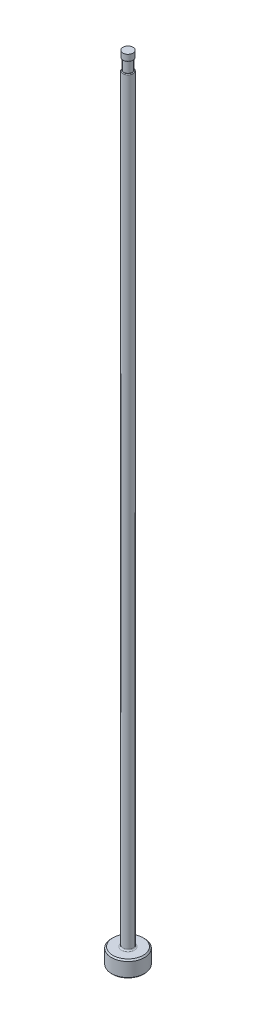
ISO-10303-21;
HEADER;
FILE_DESCRIPTION(('STEP AP214'),'2;1');
FILE_NAME('part.step','',(''),(''),'','','');
FILE_SCHEMA(('AUTOMOTIVE_DESIGN { 1 0 10303 214 1 1 1 1 }'));
ENDSEC;
DATA;
#1=APPLICATION_CONTEXT('core data for automotive mechanical design processes');
#2=APPLICATION_PROTOCOL_DEFINITION('international standard','automotive_design',2000,#1);
#3=PRODUCT_CONTEXT('',#1,'mechanical');
#4=PRODUCT('Part','Part','',(#3));
#5=PRODUCT_RELATED_PRODUCT_CATEGORY('part','',(#4));
#6=PRODUCT_DEFINITION_FORMATION('','',#4);
#7=PRODUCT_DEFINITION_CONTEXT('part definition',#1,'design');
#8=PRODUCT_DEFINITION('design','',#6,#7);
#9=PRODUCT_DEFINITION_SHAPE('','',#8);
#10=(LENGTH_UNIT() NAMED_UNIT(*) SI_UNIT(.MILLI.,.METRE.));
#11=(NAMED_UNIT(*) PLANE_ANGLE_UNIT() SI_UNIT($,.RADIAN.));
#12=(NAMED_UNIT(*) SI_UNIT($,.STERADIAN.) SOLID_ANGLE_UNIT());
#13=UNCERTAINTY_MEASURE_WITH_UNIT(LENGTH_MEASURE(1.E-05),#10,'distance_accuracy_value','');
#14=(GEOMETRIC_REPRESENTATION_CONTEXT(3) GLOBAL_UNCERTAINTY_ASSIGNED_CONTEXT((#13)) GLOBAL_UNIT_ASSIGNED_CONTEXT((#10,
#11,#12)) REPRESENTATION_CONTEXT('',''));
#15=CARTESIAN_POINT('',(0.,0.,0.));
#16=DIRECTION('',(0.,0.,1.));
#17=DIRECTION('',(1.,0.,0.));
#18=AXIS2_PLACEMENT_3D('',#15,#16,#17);
#19=CARTESIAN_POINT('',(-0.991869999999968,151.13,0.));
#20=DIRECTION('',(0.,1.,0.));
#21=DIRECTION('',(0.,0.,1.));
#22=AXIS2_PLACEMENT_3D('',#19,#20,#21);
#23=PLANE('',#22);
#24=CARTESIAN_POINT('',(0.,151.13,0.));
#25=DIRECTION('',(0.,1.,0.));
#26=DIRECTION('',(0.,0.,1.));
#27=AXIS2_PLACEMENT_3D('',#24,#25,#26);
#28=CIRCLE('',#27,0.852169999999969);
#29=CARTESIAN_POINT('',(0.,151.13,0.852169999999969));
#30=VERTEX_POINT('',#29);
#31=EDGE_CURVE('E11',#30,#30,#28,.F.);
#32=ORIENTED_EDGE('',*,*,#31,.T.);
#33=EDGE_LOOP('',(#32));
#34=FACE_BOUND('',#33,.T.);
#35=CARTESIAN_POINT('',(0.,151.13,0.));
#36=DIRECTION('',(0.,1.,0.));
#37=DIRECTION('',(0.,0.,1.));
#38=AXIS2_PLACEMENT_3D('',#35,#36,#37);
#39=CIRCLE('',#38,0.788669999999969);
#40=CARTESIAN_POINT('',(0.,151.13,0.788669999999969));
#41=VERTEX_POINT('',#40);
#42=EDGE_CURVE('E78',#41,#41,#39,.T.);
#43=ORIENTED_EDGE('',*,*,#42,.T.);
#44=EDGE_LOOP('',(#43));
#45=FACE_BOUND('',#44,.T.);
#46=ADVANCED_FACE('F36',(#34,#45),#23,.F.);
#47=CARTESIAN_POINT('',(0.,259.958771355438,0.));
#48=DIRECTION('',(0.,1.,0.));
#49=DIRECTION('',(0.,0.,1.));
#50=AXIS2_PLACEMENT_3D('',#47,#48,#49);
#51=CYLINDRICAL_SURFACE('',#50,0.991869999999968);
#52=DIRECTION('',(0.,1.,0.));
#53=VECTOR('',#52,1.);
#54=CARTESIAN_POINT('',(-0.788669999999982,259.958771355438,-0.601502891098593));
#55=LINE('',#54,#53);
#56=CARTESIAN_POINT('',(-0.788669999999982,148.971,-0.601502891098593));
#57=VERTEX_POINT('',#56);
#58=CARTESIAN_POINT('',(-0.788669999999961,86.614,-0.601502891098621));
#59=VERTEX_POINT('',#58);
#60=EDGE_CURVE('E73',#57,#59,#55,.F.);
#61=ORIENTED_EDGE('',*,*,#60,.F.);
#62=CARTESIAN_POINT('',(0.,148.971,0.));
#63=DIRECTION('',(0.,-1.,0.));
#64=DIRECTION('',(0.,0.,-1.));
#65=AXIS2_PLACEMENT_3D('',#62,#63,#64);
#66=CIRCLE('',#65,0.991869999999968);
#67=CARTESIAN_POINT('',(-0.788669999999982,148.971,0.601502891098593));
#68=VERTEX_POINT('',#67);
#69=EDGE_CURVE('E51',#57,#68,#66,.T.);
#70=ORIENTED_EDGE('',*,*,#69,.T.);
#71=DIRECTION('',(0.,1.,0.));
#72=VECTOR('',#71,1.);
#73=CARTESIAN_POINT('',(-0.788669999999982,259.958771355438,0.601502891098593));
#74=LINE('',#73,#72);
#75=CARTESIAN_POINT('',(-0.788669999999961,86.614,0.601502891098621));
#76=VERTEX_POINT('',#75);
#77=EDGE_CURVE('E84',#76,#68,#74,.T.);
#78=ORIENTED_EDGE('',*,*,#77,.F.);
#79=CARTESIAN_POINT('',(-0.78866999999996,86.614,-0.601502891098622));
#80=CARTESIAN_POINT('',(-0.788666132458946,86.5723657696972,-0.601487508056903));
#81=CARTESIAN_POINT('',(-0.789488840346,86.5307268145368,-0.600428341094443));
#82=CARTESIAN_POINT('',(-0.792762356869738,86.4475772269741,-0.596110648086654));
#83=CARTESIAN_POINT('',(-0.795215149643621,86.4060668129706,-0.5928494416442));
#84=CARTESIAN_POINT('',(-0.801750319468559,86.3230760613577,-0.583979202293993));
#85=CARTESIAN_POINT('',(-0.80584587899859,86.2815987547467,-0.578351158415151));
#86=CARTESIAN_POINT('',(-0.815598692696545,86.1992848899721,-0.564514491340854));
#87=CARTESIAN_POINT('',(-0.821255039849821,86.1584479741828,-0.556307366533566));
#88=CARTESIAN_POINT('',(-0.835799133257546,86.0664854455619,-0.534292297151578));
#89=CARTESIAN_POINT('',(-0.845147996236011,86.015646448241,-0.51956237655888));
#90=CARTESIAN_POINT('',(-0.865829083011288,85.9164630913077,-0.484320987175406));
#91=CARTESIAN_POINT('',(-0.877157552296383,85.868114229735,-0.463820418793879));
#92=CARTESIAN_POINT('',(-0.898053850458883,85.787005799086,-0.421558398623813));
#93=CARTESIAN_POINT('',(-0.907358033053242,85.7533614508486,-0.401380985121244));
#94=CARTESIAN_POINT('',(-0.926056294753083,85.6895419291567,-0.356125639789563));
#95=CARTESIAN_POINT('',(-0.935450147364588,85.6593597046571,-0.331057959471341));
#96=CARTESIAN_POINT('',(-0.950231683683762,85.6139121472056,-0.285005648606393));
#97=CARTESIAN_POINT('',(-0.955876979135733,85.5971082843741,-0.265630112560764));
#98=CARTESIAN_POINT('',(-0.966384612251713,85.5665435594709,-0.224405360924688));
#99=CARTESIAN_POINT('',(-0.971247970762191,85.5527787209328,-0.202559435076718));
#100=CARTESIAN_POINT('',(-0.978947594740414,85.5313348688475,-0.16073053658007));
#101=CARTESIAN_POINT('',(-0.981991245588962,85.5230060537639,-0.141121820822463));
#102=CARTESIAN_POINT('',(-0.986954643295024,85.5095350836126,-0.100697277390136));
#103=CARTESIAN_POINT('',(-0.988875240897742,85.5043905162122,-0.0798823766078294));
#104=CARTESIAN_POINT('',(-0.991389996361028,85.4976710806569,-0.0374802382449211));
#105=CARTESIAN_POINT('',(-0.991977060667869,85.4961153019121,-0.0158894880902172));
#106=CARTESIAN_POINT('',(-0.991730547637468,85.4967708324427,0.0272258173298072));
#107=CARTESIAN_POINT('',(-0.990897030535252,85.4989819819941,0.0487503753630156));
#108=CARTESIAN_POINT('',(-0.988037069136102,85.5066392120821,0.0892607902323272));
#109=CARTESIAN_POINT('',(-0.986115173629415,85.511802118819,0.108309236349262));
#110=CARTESIAN_POINT('',(-0.98134109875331,85.5247860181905,0.145344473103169));
#111=CARTESIAN_POINT('',(-0.978488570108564,85.5326080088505,0.163330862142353));
#112=CARTESIAN_POINT('',(-0.970708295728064,85.5542895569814,0.205331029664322));
#113=CARTESIAN_POINT('',(-0.96541298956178,85.5693036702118,0.228680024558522));
#114=CARTESIAN_POINT('',(-0.953964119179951,85.6027581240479,0.272534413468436));
#115=CARTESIAN_POINT('',(-0.947808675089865,85.6212059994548,0.293033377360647));
#116=CARTESIAN_POINT('',(-0.931801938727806,85.6709271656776,0.341318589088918));
#117=CARTESIAN_POINT('',(-0.921702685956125,85.7038591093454,0.367302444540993));
#118=CARTESIAN_POINT('',(-0.901756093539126,85.7733884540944,0.413864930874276));
#119=CARTESIAN_POINT('',(-0.891909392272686,85.8099941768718,0.434430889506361));
#120=CARTESIAN_POINT('',(-0.874578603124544,85.8796825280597,0.468207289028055));
#121=CARTESIAN_POINT('',(-0.866965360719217,85.9124263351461,0.482064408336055));
#122=CARTESIAN_POINT('',(-0.852602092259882,85.97913810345,0.507032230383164));
#123=CARTESIAN_POINT('',(-0.845852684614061,86.0131069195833,0.518140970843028));
#124=CARTESIAN_POINT('',(-0.827119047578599,86.1164444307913,0.547946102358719));
#125=CARTESIAN_POINT('',(-0.816676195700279,86.1871386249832,0.56307398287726));
#126=CARTESIAN_POINT('',(-0.801997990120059,86.317402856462,0.583716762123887));
#127=CARTESIAN_POINT('',(-0.796987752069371,86.3767084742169,0.590464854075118));
#128=CARTESIAN_POINT('',(-0.791992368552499,86.4658069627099,0.597127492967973));
#129=CARTESIAN_POINT('',(-0.790747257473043,86.4954091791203,0.598772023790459));
#130=CARTESIAN_POINT('',(-0.789085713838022,86.5546736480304,0.600958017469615));
#131=CARTESIAN_POINT('',(-0.788669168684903,86.5843358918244,0.601499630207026));
#132=CARTESIAN_POINT('',(-0.788669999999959,86.614,0.601502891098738));
#133=B_SPLINE_CURVE_WITH_KNOTS('',3,(#79,#80,#81,#82,#83,#84,#85,#86,#87,#88,#89,#90,#91,#92,
#93,#94,#95,#96,#97,#98,#99,#100,#101,#102,#103,#104,#105,#106,#107,#108,#109,#110,#111,#112,
#113,#114,#115,#116,#117,#118,#119,#120,#121,#122,#123,#124,#125,#126,#127,#128,#129,#130,#131,
#132),.UNSPECIFIED.,.F.,.F.,(4,2,2,2,2,2,2,2,2,2,2,2,2,2,2,2,2,2,2,2,2,2,2,2,2,2,4),(0.,
0.124888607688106,0.249929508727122,0.375994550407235,0.501986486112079,0.662910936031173,
0.823533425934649,0.944174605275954,1.06456554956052,1.14311274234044,1.22155654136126,
1.28585720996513,1.350109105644,1.41470198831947,1.47929213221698,1.53853130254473,
1.59779273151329,1.68209646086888,1.76658740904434,1.89530637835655,2.02432379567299,
2.13325396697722,2.24226168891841,2.46062960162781,2.64005592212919,2.72904839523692,
2.81802877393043),.UNSPECIFIED.);
#134=EDGE_CURVE('E81',#59,#76,#133,.T.);
#135=ORIENTED_EDGE('',*,*,#134,.F.);
#136=EDGE_LOOP('',(#61,#70,#78,#135));
#137=FACE_BOUND('',#136,.T.);
#138=CARTESIAN_POINT('',(0.,3.42900000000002,0.));
#139=DIRECTION('',(0.,1.,0.));
#140=DIRECTION('',(0.,0.,1.));
#141=AXIS2_PLACEMENT_3D('',#138,#139,#140);
#142=CIRCLE('',#141,0.991869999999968);
#143=CARTESIAN_POINT('',(0.,3.42900000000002,0.991869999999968));
#144=VERTEX_POINT('',#143);
#145=EDGE_CURVE('E116',#144,#144,#142,.T.);
#146=ORIENTED_EDGE('',*,*,#145,.T.);
#147=EDGE_LOOP('',(#146));
#148=FACE_BOUND('',#147,.T.);
#149=ADVANCED_FACE('F82',(#137,#148),#51,.T.);
#150=CARTESIAN_POINT('',(0.,0.,0.));
#151=DIRECTION('',(0.,-1.,0.));
#152=DIRECTION('',(0.,0.,-1.));
#153=AXIS2_PLACEMENT_3D('',#150,#151,#152);
#154=PLANE('',#153);
#155=CARTESIAN_POINT('',(0.,0.,0.));
#156=DIRECTION('',(0.,-1.,0.));
#157=DIRECTION('',(0.,0.,-1.));
#158=AXIS2_PLACEMENT_3D('',#155,#156,#157);
#159=CIRCLE('',#158,2.92099999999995);
#160=CARTESIAN_POINT('',(0.,0.,-2.92099999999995));
#161=VERTEX_POINT('',#160);
#162=EDGE_CURVE('E113',#161,#161,#159,.T.);
#163=ORIENTED_EDGE('',*,*,#162,.T.);
#164=EDGE_LOOP('',(#163));
#165=FACE_BOUND('',#164,.T.);
#166=ADVANCED_FACE('F192',(#165),#154,.T.);
#167=CARTESIAN_POINT('',(0.,259.958771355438,0.));
#168=DIRECTION('',(0.,1.,0.));
#169=DIRECTION('',(0.,0.,1.));
#170=AXIS2_PLACEMENT_3D('',#167,#168,#169);
#171=CYLINDRICAL_SURFACE('',#170,3.17499999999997);
#172=CARTESIAN_POINT('',(0.,2.92100000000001,0.));
#173=DIRECTION('',(0.,1.,0.));
#174=DIRECTION('',(0.,0.,1.));
#175=AXIS2_PLACEMENT_3D('',#172,#173,#174);
#176=CIRCLE('',#175,3.17499999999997);
#177=CARTESIAN_POINT('',(0.,2.92100000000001,3.17499999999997));
#178=VERTEX_POINT('',#177);
#179=EDGE_CURVE('E110',#178,#178,#176,.F.);
#180=ORIENTED_EDGE('',*,*,#179,.T.);
#181=EDGE_LOOP('',(#180));
#182=FACE_BOUND('',#181,.T.);
#183=CARTESIAN_POINT('',(0.,0.254000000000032,0.));
#184=DIRECTION('',(0.,-1.,0.));
#185=DIRECTION('',(0.,0.,-1.));
#186=AXIS2_PLACEMENT_3D('',#183,#184,#185);
#187=CIRCLE('',#186,3.17499999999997);
#188=CARTESIAN_POINT('',(0.,0.254000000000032,-3.17499999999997));
#189=VERTEX_POINT('',#188);
#190=EDGE_CURVE('E107',#189,#189,#187,.F.);
#191=ORIENTED_EDGE('',*,*,#190,.T.);
#192=EDGE_LOOP('',(#191));
#193=FACE_BOUND('',#192,.T.);
#194=ADVANCED_FACE('F195',(#182,#193),#171,.T.);
#195=CARTESIAN_POINT('',(-3.17499999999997,3.175,0.));
#196=DIRECTION('',(0.,1.,0.));
#197=DIRECTION('',(0.,0.,1.));
#198=AXIS2_PLACEMENT_3D('',#195,#196,#197);
#199=PLANE('',#198);
#200=CARTESIAN_POINT('',(0.,3.175,0.));
#201=DIRECTION('',(0.,1.,0.));
#202=DIRECTION('',(0.,0.,1.));
#203=AXIS2_PLACEMENT_3D('',#200,#201,#202);
#204=CIRCLE('',#203,1.24586999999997);
#205=CARTESIAN_POINT('',(0.,3.175,1.24586999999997));
#206=VERTEX_POINT('',#205);
#207=EDGE_CURVE('E87',#206,#206,#204,.F.);
#208=ORIENTED_EDGE('',*,*,#207,.T.);
#209=EDGE_LOOP('',(#208));
#210=FACE_BOUND('',#209,.T.);
#211=CARTESIAN_POINT('',(0.,3.175,0.));
#212=DIRECTION('',(0.,1.,0.));
#213=DIRECTION('',(0.,0.,1.));
#214=AXIS2_PLACEMENT_3D('',#211,#212,#213);
#215=CIRCLE('',#214,2.92099999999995);
#216=CARTESIAN_POINT('',(0.,3.175,2.92099999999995));
#217=VERTEX_POINT('',#216);
#218=EDGE_CURVE('E104',#217,#217,#215,.T.);
#219=ORIENTED_EDGE('',*,*,#218,.T.);
#220=EDGE_LOOP('',(#219));
#221=FACE_BOUND('',#220,.T.);
#222=ADVANCED_FACE('F190',(#210,#221),#199,.T.);
#223=CARTESIAN_POINT('',(0.,3.17499999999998,0.));
#224=DIRECTION('',(0.,-1.,0.));
#225=DIRECTION('',(0.,0.,-1.));
#226=AXIS2_PLACEMENT_3D('',#223,#224,#225);
#227=CONICAL_SURFACE('',#226,2.92099999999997,0.7853981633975);
#228=ORIENTED_EDGE('',*,*,#179,.F.);
#229=EDGE_LOOP('',(#228));
#230=FACE_BOUND('',#229,.T.);
#231=ORIENTED_EDGE('',*,*,#218,.F.);
#232=EDGE_LOOP('',(#231));
#233=FACE_BOUND('',#232,.T.);
#234=ADVANCED_FACE('F186',(#230,#233),#227,.T.);
#235=CARTESIAN_POINT('',(0.,0.254000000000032,0.));
#236=DIRECTION('',(0.,1.,0.));
#237=DIRECTION('',(0.,0.,1.));
#238=AXIS2_PLACEMENT_3D('',#235,#236,#237);
#239=CONICAL_SURFACE('',#238,3.17499999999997,0.785398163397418);
#240=ORIENTED_EDGE('',*,*,#162,.F.);
#241=EDGE_LOOP('',(#240));
#242=FACE_BOUND('',#241,.T.);
#243=ORIENTED_EDGE('',*,*,#190,.F.);
#244=EDGE_LOOP('',(#243));
#245=FACE_BOUND('',#244,.T.);
#246=ADVANCED_FACE('F182',(#242,#245),#239,.T.);
#247=CARTESIAN_POINT('',(0.,3.42900000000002,0.));
#248=DIRECTION('',(0.,1.,0.));
#249=DIRECTION('',(0.,0.,1.));
#250=AXIS2_PLACEMENT_3D('',#247,#248,#249);
#251=TOROIDAL_SURFACE('',#250,1.24586999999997,0.254);
#252=ORIENTED_EDGE('',*,*,#207,.F.);
#253=EDGE_LOOP('',(#252));
#254=FACE_BOUND('',#253,.T.);
#255=ORIENTED_EDGE('',*,*,#145,.F.);
#256=EDGE_LOOP('',(#255));
#257=FACE_BOUND('',#256,.T.);
#258=ADVANCED_FACE('F147',(#254,#257),#251,.F.);
#259=CARTESIAN_POINT('',(-0.991869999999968,149.098,0.));
#260=DIRECTION('',(0.,-1.,0.));
#261=DIRECTION('',(0.,0.,-1.));
#262=AXIS2_PLACEMENT_3D('',#259,#260,#261);
#263=PLANE('',#262);
#264=DIRECTION('',(0.,0.,1.));
#265=VECTOR('',#264,1.);
#266=CARTESIAN_POINT('',(-0.788669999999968,149.098,0.));
#267=LINE('',#266,#265);
#268=CARTESIAN_POINT('',(-0.788669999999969,149.098,0.));
#269=VERTEX_POINT('',#268);
#270=CARTESIAN_POINT('',(-0.788669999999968,149.098,0.354964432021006));
#271=VERTEX_POINT('',#270);
#272=EDGE_CURVE('E90',#269,#271,#267,.T.);
#273=ORIENTED_EDGE('',*,*,#272,.T.);
#274=CARTESIAN_POINT('',(0.,149.098,0.));
#275=DIRECTION('',(0.,-1.,0.));
#276=DIRECTION('',(0.,0.,-1.));
#277=AXIS2_PLACEMENT_3D('',#274,#275,#276);
#278=CIRCLE('',#277,0.864869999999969);
#279=CARTESIAN_POINT('',(-0.788669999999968,149.098,-0.354964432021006));
#280=VERTEX_POINT('',#279);
#281=EDGE_CURVE('E86',#271,#280,#278,.F.);
#282=ORIENTED_EDGE('',*,*,#281,.T.);
#283=EDGE_CURVE('E79',#280,#269,#267,.T.);
#284=ORIENTED_EDGE('',*,*,#283,.T.);
#285=CARTESIAN_POINT('',(0.,149.098,0.));
#286=DIRECTION('',(0.,1.,0.));
#287=DIRECTION('',(0.,0.,1.));
#288=AXIS2_PLACEMENT_3D('',#285,#286,#287);
#289=CIRCLE('',#288,0.788669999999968);
#290=EDGE_CURVE('E101',#269,#269,#289,.T.);
#291=ORIENTED_EDGE('',*,*,#290,.F.);
#292=EDGE_LOOP('',(#273,#282,#284,#291));
#293=FACE_BOUND('',#292,.T.);
#294=ADVANCED_FACE('F144',(#293),#263,.F.);
#295=CARTESIAN_POINT('',(0.,153.448281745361,0.));
#296=DIRECTION('',(0.,1.,0.));
#297=DIRECTION('',(0.,0.,1.));
#298=AXIS2_PLACEMENT_3D('',#295,#296,#297);
#299=CYLINDRICAL_SURFACE('',#298,0.788669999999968);
#300=ORIENTED_EDGE('',*,*,#42,.F.);
#301=EDGE_LOOP('',(#300));
#302=FACE_BOUND('',#301,.T.);
#303=ORIENTED_EDGE('',*,*,#290,.T.);
#304=EDGE_LOOP('',(#303));
#305=FACE_BOUND('',#304,.T.);
#306=ADVANCED_FACE('F141',(#302,#305),#299,.T.);
#307=CARTESIAN_POINT('',(-0.788669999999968,150.114,-3.17499999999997));
#308=DIRECTION('',(1.,0.,0.));
#309=DIRECTION('',(0.,1.,0.));
#310=AXIS2_PLACEMENT_3D('',#307,#308,#309);
#311=PLANE('',#310);
#312=ORIENTED_EDGE('',*,*,#283,.F.);
#313=CARTESIAN_POINT('',(-0.788669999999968,149.098,-0.354964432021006));
#314=CARTESIAN_POINT('',(-0.788669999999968,149.097991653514,-0.368137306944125));
#315=CARTESIAN_POINT('',(-0.788669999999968,149.097653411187,-0.381328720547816));
#316=CARTESIAN_POINT('',(-0.788669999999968,149.096063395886,-0.40778985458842));
#317=CARTESIAN_POINT('',(-0.788669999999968,149.094802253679,-0.421058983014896));
#318=CARTESIAN_POINT('',(-0.788669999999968,149.091062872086,-0.447724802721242));
#319=CARTESIAN_POINT('',(-0.788669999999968,149.088559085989,-0.461118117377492));
#320=CARTESIAN_POINT('',(-0.788669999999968,149.081968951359,-0.487472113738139));
#321=CARTESIAN_POINT('',(-0.788669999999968,149.077890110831,-0.500434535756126));
#322=CARTESIAN_POINT('',(-0.788669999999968,149.070061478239,-0.519670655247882));
#323=CARTESIAN_POINT('',(-0.788669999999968,149.06704648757,-0.526242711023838));
#324=CARTESIAN_POINT('',(-0.788669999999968,149.060344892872,-0.53902776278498));
#325=CARTESIAN_POINT('',(-0.788669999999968,149.056659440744,-0.545241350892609));
#326=CARTESIAN_POINT('',(-0.788669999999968,149.048480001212,-0.557211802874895));
#327=CARTESIAN_POINT('',(-0.788669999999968,149.043978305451,-0.56296348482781));
#328=CARTESIAN_POINT('',(-0.788669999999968,149.034105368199,-0.573676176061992));
#329=CARTESIAN_POINT('',(-0.788669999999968,149.028735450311,-0.578638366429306));
#330=CARTESIAN_POINT('',(-0.788669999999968,149.018914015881,-0.586040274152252));
#331=CARTESIAN_POINT('',(-0.788669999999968,149.014693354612,-0.588785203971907));
#332=CARTESIAN_POINT('',(-0.788669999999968,149.005874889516,-0.593566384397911));
#333=CARTESIAN_POINT('',(-0.788669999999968,149.001278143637,-0.595604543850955));
#334=CARTESIAN_POINT('',(-0.788669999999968,148.99244552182,-0.598606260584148));
#335=CARTESIAN_POINT('',(-0.788669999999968,148.988247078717,-0.599679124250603));
#336=CARTESIAN_POINT('',(-0.788669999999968,148.97970249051,-0.60113386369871));
#337=CARTESIAN_POINT('',(-0.788669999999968,148.975355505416,-0.601510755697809));
#338=CARTESIAN_POINT('',(-0.788669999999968,148.971,-0.601502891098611));
#339=B_SPLINE_CURVE_WITH_KNOTS('',3,(#313,#314,#315,#316,#317,#318,#319,#320,#321,#322,#323,
#324,#325,#326,#327,#328,#329,#330,#331,#332,#333,#334,#335,#336,#337,#338),.UNSPECIFIED.,.F.,
.F.,(4,2,2,2,2,2,2,2,2,2,2,2,4),(0.,0.039543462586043,0.0794940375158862,0.120302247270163,
0.160918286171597,0.182579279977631,0.204203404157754,0.226043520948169,0.247850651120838,
0.262901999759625,0.27791237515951,0.290856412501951,0.303892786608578),.UNSPECIFIED.);
#340=EDGE_CURVE('E59',#280,#57,#339,.T.);
#341=ORIENTED_EDGE('',*,*,#340,.T.);
#342=ORIENTED_EDGE('',*,*,#60,.T.);
#343=DIRECTION('',(0.,0.,1.));
#344=VECTOR('',#343,1.);
#345=CARTESIAN_POINT('',(-0.788669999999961,86.614,-3.17499999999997));
#346=LINE('',#345,#344);
#347=EDGE_CURVE('E77',#59,#76,#346,.T.);
#348=ORIENTED_EDGE('',*,*,#347,.T.);
#349=ORIENTED_EDGE('',*,*,#77,.T.);
#350=CARTESIAN_POINT('',(-0.788669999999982,148.971,0.601502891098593));
#351=CARTESIAN_POINT('',(-0.788669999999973,148.976166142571,0.601517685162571));
#352=CARTESIAN_POINT('',(-0.78866999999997,148.981314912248,0.600984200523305));
#353=CARTESIAN_POINT('',(-0.788669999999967,148.991363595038,0.598952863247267));
#354=CARTESIAN_POINT('',(-0.788669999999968,148.996265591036,0.597465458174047));
#355=CARTESIAN_POINT('',(-0.788669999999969,149.005706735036,0.59366073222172));
#356=CARTESIAN_POINT('',(-0.788669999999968,149.010247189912,0.591346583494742));
#357=CARTESIAN_POINT('',(-0.788669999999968,149.018926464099,0.586045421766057));
#358=CARTESIAN_POINT('',(-0.788669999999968,149.023064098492,0.583056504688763));
#359=CARTESIAN_POINT('',(-0.788669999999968,149.032796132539,0.574987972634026));
#360=CARTESIAN_POINT('',(-0.788669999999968,149.038130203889,0.569595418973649));
#361=CARTESIAN_POINT('',(-0.788669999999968,149.047886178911,0.558050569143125));
#362=CARTESIAN_POINT('',(-0.788669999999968,149.052306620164,0.551897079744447));
#363=CARTESIAN_POINT('',(-0.788669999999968,149.062844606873,0.535097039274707));
#364=CARTESIAN_POINT('',(-0.788669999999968,149.068303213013,0.524040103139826));
#365=CARTESIAN_POINT('',(-0.788669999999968,149.077553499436,0.501210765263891));
#366=CARTESIAN_POINT('',(-0.788669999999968,149.081334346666,0.489434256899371));
#367=CARTESIAN_POINT('',(-0.788669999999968,149.089711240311,0.457304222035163));
#368=CARTESIAN_POINT('',(-0.788669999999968,149.093073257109,0.436633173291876));
#369=CARTESIAN_POINT('',(-0.788669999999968,149.096171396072,0.405739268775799));
#370=CARTESIAN_POINT('',(-0.788669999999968,149.096882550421,0.395580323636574));
#371=CARTESIAN_POINT('',(-0.788669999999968,149.097795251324,0.375270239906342));
#372=CARTESIAN_POINT('',(-0.788669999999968,149.097998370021,0.365119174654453));
#373=CARTESIAN_POINT('',(-0.788669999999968,149.098,0.354964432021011));
#374=B_SPLINE_CURVE_WITH_KNOTS('',3,(#350,#351,#352,#353,#354,#355,#356,#357,#358,#359,#360,
#361,#362,#363,#364,#365,#366,#367,#368,#369,#370,#371,#372,#373),.UNSPECIFIED.,.F.,.F.,(4,2,2,
2,2,2,2,2,2,2,2,4),(0.,0.0154434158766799,0.0307205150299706,0.0459396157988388,
0.0612022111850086,0.0838287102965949,0.106491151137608,0.14327546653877,0.180293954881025,
0.24282537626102,0.273372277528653,0.303824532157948),.UNSPECIFIED.);
#375=EDGE_CURVE('E172',#68,#271,#374,.T.);
#376=ORIENTED_EDGE('',*,*,#375,.T.);
#377=ORIENTED_EDGE('',*,*,#272,.F.);
#378=EDGE_LOOP('',(#312,#341,#342,#348,#349,#376,#377));
#379=FACE_BOUND('',#378,.T.);
#380=ADVANCED_FACE('F75',(#379),#311,.F.);
#381=CARTESIAN_POINT('',(-3.96366999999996,86.614,-3.17499999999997));
#382=DIRECTION('',(0.,0.,1.));
#383=DIRECTION('',(1.,0.,0.));
#384=AXIS2_PLACEMENT_3D('',#381,#382,#383);
#385=CYLINDRICAL_SURFACE('',#384,3.175);
#386=ORIENTED_EDGE('',*,*,#347,.F.);
#387=ORIENTED_EDGE('',*,*,#134,.T.);
#388=EDGE_LOOP('',(#386,#387));
#389=FACE_BOUND('',#388,.T.);
#390=ADVANCED_FACE('F89',(#389),#385,.F.);
#391=CARTESIAN_POINT('',(0.,152.687735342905,0.));
#392=DIRECTION('',(0.,1.,0.));
#393=DIRECTION('',(0.,0.,1.));
#394=AXIS2_PLACEMENT_3D('',#391,#392,#393);
#395=CYLINDRICAL_SURFACE('',#394,0.979169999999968);
#396=CARTESIAN_POINT('',(0.,151.257,0.));
#397=DIRECTION('',(0.,1.,0.));
#398=DIRECTION('',(0.,0.,1.));
#399=AXIS2_PLACEMENT_3D('',#396,#397,#398);
#400=CIRCLE('',#399,0.979169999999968);
#401=CARTESIAN_POINT('',(0.,151.257,0.979169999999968));
#402=VERTEX_POINT('',#401);
#403=EDGE_CURVE('E44',#402,#402,#400,.T.);
#404=ORIENTED_EDGE('',*,*,#403,.T.);
#405=EDGE_LOOP('',(#404));
#406=FACE_BOUND('',#405,.T.);
#407=CARTESIAN_POINT('',(0.,152.4,0.));
#408=DIRECTION('',(0.,1.,0.));
#409=DIRECTION('',(0.,0.,1.));
#410=AXIS2_PLACEMENT_3D('',#407,#408,#409);
#411=CIRCLE('',#410,0.979169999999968);
#412=CARTESIAN_POINT('',(0.,152.4,0.979169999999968));
#413=VERTEX_POINT('',#412);
#414=EDGE_CURVE('E91',#413,#413,#411,.T.);
#415=ORIENTED_EDGE('',*,*,#414,.F.);
#416=EDGE_LOOP('',(#415));
#417=FACE_BOUND('',#416,.T.);
#418=ADVANCED_FACE('F135',(#406,#417),#395,.T.);
#419=CARTESIAN_POINT('',(-0.991869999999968,152.4,0.));
#420=DIRECTION('',(0.,1.,0.));
#421=DIRECTION('',(0.,0.,1.));
#422=AXIS2_PLACEMENT_3D('',#419,#420,#421);
#423=PLANE('',#422);
#424=ORIENTED_EDGE('',*,*,#414,.T.);
#425=EDGE_LOOP('',(#424));
#426=FACE_BOUND('',#425,.T.);
#427=ADVANCED_FACE('F149',(#426),#423,.T.);
#428=CARTESIAN_POINT('',(0.,148.971,0.));
#429=DIRECTION('',(0.,-1.,0.));
#430=DIRECTION('',(0.,0.,-1.));
#431=AXIS2_PLACEMENT_3D('',#428,#429,#430);
#432=TOROIDAL_SURFACE('',#431,0.864869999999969,0.127);
#433=ORIENTED_EDGE('',*,*,#375,.F.);
#434=ORIENTED_EDGE('',*,*,#69,.F.);
#435=ORIENTED_EDGE('',*,*,#340,.F.);
#436=ORIENTED_EDGE('',*,*,#281,.F.);
#437=EDGE_LOOP('',(#433,#434,#435,#436));
#438=FACE_BOUND('',#437,.T.);
#439=ADVANCED_FACE('F151',(#438),#432,.T.);
#440=CARTESIAN_POINT('',(0.,151.257,0.));
#441=DIRECTION('',(0.,1.,0.));
#442=DIRECTION('',(0.,0.,1.));
#443=AXIS2_PLACEMENT_3D('',#440,#441,#442);
#444=TOROIDAL_SURFACE('',#443,0.852169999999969,0.127);
#445=ORIENTED_EDGE('',*,*,#31,.F.);
#446=EDGE_LOOP('',(#445));
#447=FACE_BOUND('',#446,.T.);
#448=ORIENTED_EDGE('',*,*,#403,.F.);
#449=EDGE_LOOP('',(#448));
#450=FACE_BOUND('',#449,.T.);
#451=ADVANCED_FACE('F38',(#447,#450),#444,.T.);
#452=CLOSED_SHELL('',(#46,#149,#166,#194,#222,#234,#246,#258,#294,#306,#380,#390,#418,#427,#439,#451));
#453=MANIFOLD_SOLID_BREP('B2',#452);
#454=ADVANCED_BREP_SHAPE_REPRESENTATION('',(#18,#453),#14);
#455=SHAPE_DEFINITION_REPRESENTATION(#9,#454);
ENDSEC;
END-ISO-10303-21;
